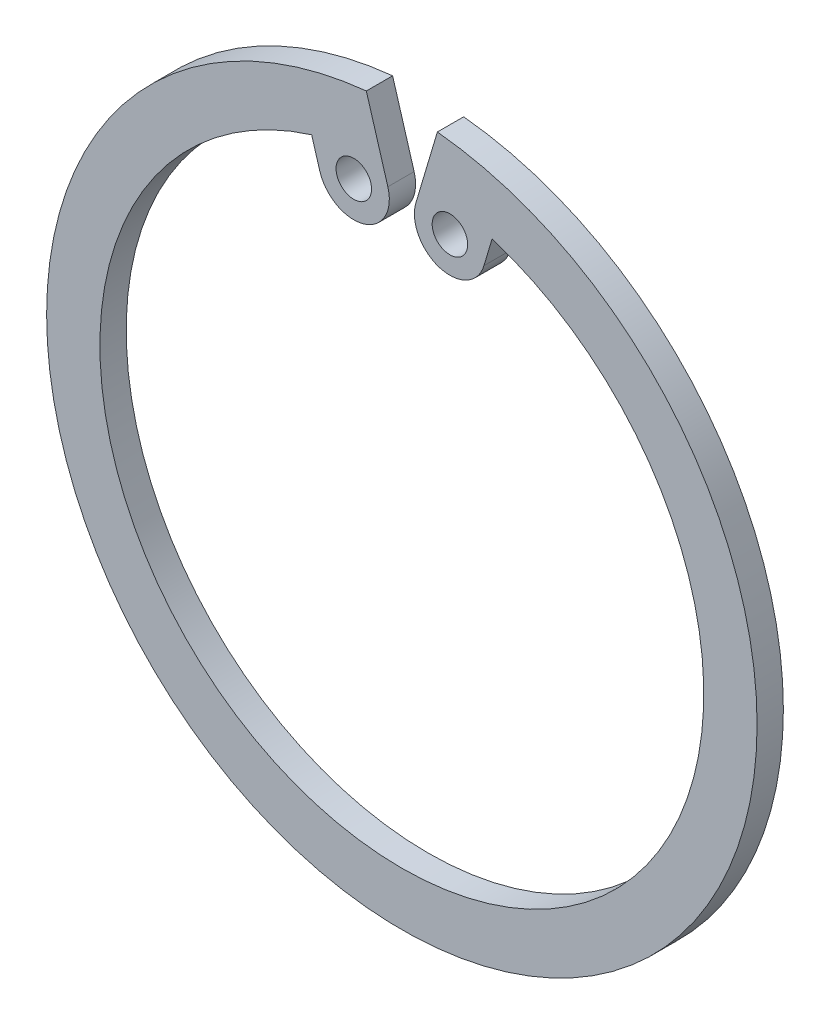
ISO-10303-21;
HEADER;
FILE_DESCRIPTION(('STEP AP214'),'2;1');
FILE_NAME('part.step','',(''),(''),'','','');
FILE_SCHEMA(('AUTOMOTIVE_DESIGN { 1 0 10303 214 1 1 1 1 }'));
ENDSEC;
DATA;
#1=APPLICATION_CONTEXT('core data for automotive mechanical design processes');
#2=APPLICATION_PROTOCOL_DEFINITION('international standard','automotive_design',2000,#1);
#3=PRODUCT_CONTEXT('',#1,'mechanical');
#4=PRODUCT('Part','Part','',(#3));
#5=PRODUCT_RELATED_PRODUCT_CATEGORY('part','',(#4));
#6=PRODUCT_DEFINITION_FORMATION('','',#4);
#7=PRODUCT_DEFINITION_CONTEXT('part definition',#1,'design');
#8=PRODUCT_DEFINITION('design','',#6,#7);
#9=PRODUCT_DEFINITION_SHAPE('','',#8);
#10=(LENGTH_UNIT() NAMED_UNIT(*) SI_UNIT(.MILLI.,.METRE.));
#11=(NAMED_UNIT(*) PLANE_ANGLE_UNIT() SI_UNIT($,.RADIAN.));
#12=(NAMED_UNIT(*) SI_UNIT($,.STERADIAN.) SOLID_ANGLE_UNIT());
#13=UNCERTAINTY_MEASURE_WITH_UNIT(LENGTH_MEASURE(1.E-05),#10,'distance_accuracy_value','');
#14=(GEOMETRIC_REPRESENTATION_CONTEXT(3) GLOBAL_UNCERTAINTY_ASSIGNED_CONTEXT((#13)) GLOBAL_UNIT_ASSIGNED_CONTEXT((#10,
#11,#12)) REPRESENTATION_CONTEXT('',''));
#15=CARTESIAN_POINT('',(0.,0.,0.));
#16=DIRECTION('',(0.,0.,1.));
#17=DIRECTION('',(1.,0.,0.));
#18=AXIS2_PLACEMENT_3D('',#15,#16,#17);
#19=CARTESIAN_POINT('',(2.70579329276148,15.262001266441,1.48));
#20=DIRECTION('',(0.,0.,-1.));
#21=DIRECTION('',(-1.,0.,0.));
#22=AXIS2_PLACEMENT_3D('',#19,#20,#21);
#23=PLANE('',#22);
#24=CARTESIAN_POINT('',(2.70579329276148,15.262001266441,1.48));
#25=DIRECTION('',(0.,0.,1.));
#26=DIRECTION('',(1.,0.,0.));
#27=AXIS2_PLACEMENT_3D('',#24,#25,#26);
#28=CIRCLE('',#27,1.);
#29=CARTESIAN_POINT('',(3.70579329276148,15.262001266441,1.48));
#30=VERTEX_POINT('',#29);
#31=EDGE_CURVE('E107',#30,#30,#28,.T.);
#32=ORIENTED_EDGE('',*,*,#31,.F.);
#33=EDGE_LOOP('',(#32));
#34=FACE_BOUND('',#33,.T.);
#35=CARTESIAN_POINT('',(2.70579329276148,15.262001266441,1.48));
#36=DIRECTION('',(0.,0.,-1.));
#37=DIRECTION('',(-1.,0.,0.));
#38=AXIS2_PLACEMENT_3D('',#35,#36,#37);
#39=CIRCLE('',#38,2.);
#40=CARTESIAN_POINT('',(4.62261719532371,14.6912244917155,1.48));
#41=VERTEX_POINT('',#40);
#42=CARTESIAN_POINT('',(0.788969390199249,15.8327780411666,1.48));
#43=VERTEX_POINT('',#42);
#44=EDGE_CURVE('E90',#41,#43,#39,.T.);
#45=ORIENTED_EDGE('',*,*,#44,.F.);
#46=DIRECTION('',(-0.285388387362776,-0.958411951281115,0.));
#47=VECTOR('',#46,1.);
#48=CARTESIAN_POINT('',(5.07891104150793,16.2235835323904,1.48));
#49=LINE('',#48,#47);
#50=CARTESIAN_POINT('',(5.07891104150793,16.2235835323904,1.48));
#51=VERTEX_POINT('',#50);
#52=EDGE_CURVE('E96',#51,#41,#49,.T.);
#53=ORIENTED_EDGE('',*,*,#52,.F.);
#54=CARTESIAN_POINT('',(0.,0.,1.48));
#55=DIRECTION('',(0.,0.,1.));
#56=DIRECTION('',(1.,0.,0.));
#57=AXIS2_PLACEMENT_3D('',#54,#55,#56);
#58=CIRCLE('',#57,17.);
#59=CARTESIAN_POINT('',(-5.07891104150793,16.2235835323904,1.48));
#60=VERTEX_POINT('',#59);
#61=EDGE_CURVE('E142',#60,#51,#58,.T.);
#62=ORIENTED_EDGE('',*,*,#61,.F.);
#63=DIRECTION('',(0.285388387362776,-0.958411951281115,0.));
#64=VECTOR('',#63,1.);
#65=CARTESIAN_POINT('',(-5.07891104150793,16.2235835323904,1.48));
#66=LINE('',#65,#64);
#67=CARTESIAN_POINT('',(-4.62261719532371,14.6912244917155,1.48));
#68=VERTEX_POINT('',#67);
#69=EDGE_CURVE('E139',#60,#68,#66,.T.);
#70=ORIENTED_EDGE('',*,*,#69,.T.);
#71=CARTESIAN_POINT('',(-2.70579329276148,15.262001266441,1.48));
#72=DIRECTION('',(0.,0.,1.));
#73=DIRECTION('',(1.,0.,0.));
#74=AXIS2_PLACEMENT_3D('',#71,#72,#73);
#75=CIRCLE('',#74,2.);
#76=CARTESIAN_POINT('',(-0.788969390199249,15.8327780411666,1.48));
#77=VERTEX_POINT('',#76);
#78=EDGE_CURVE('E136',#68,#77,#75,.T.);
#79=ORIENTED_EDGE('',*,*,#78,.T.);
#80=DIRECTION('',(-0.285388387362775,0.958411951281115,0.));
#81=VECTOR('',#80,1.);
#82=CARTESIAN_POINT('',(-0.788969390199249,15.8327780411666,1.48));
#83=LINE('',#82,#81);
#84=CARTESIAN_POINT('',(-2.,19.8997487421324,1.48));
#85=VERTEX_POINT('',#84);
#86=EDGE_CURVE('E133',#77,#85,#83,.T.);
#87=ORIENTED_EDGE('',*,*,#86,.T.);
#88=CARTESIAN_POINT('',(0.,0.,1.48));
#89=DIRECTION('',(0.,0.,1.));
#90=DIRECTION('',(1.,0.,0.));
#91=AXIS2_PLACEMENT_3D('',#88,#89,#90);
#92=CIRCLE('',#91,20.);
#93=CARTESIAN_POINT('',(2.,19.8997487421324,1.48));
#94=VERTEX_POINT('',#93);
#95=EDGE_CURVE('E130',#85,#94,#92,.T.);
#96=ORIENTED_EDGE('',*,*,#95,.T.);
#97=DIRECTION('',(0.285388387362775,0.958411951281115,0.));
#98=VECTOR('',#97,1.);
#99=CARTESIAN_POINT('',(0.788969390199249,15.8327780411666,1.48));
#100=LINE('',#99,#98);
#101=EDGE_CURVE('E128',#43,#94,#100,.T.);
#102=ORIENTED_EDGE('',*,*,#101,.F.);
#103=EDGE_LOOP('',(#45,#53,#62,#70,#79,#87,#96,#102));
#104=FACE_BOUND('',#103,.T.);
#105=CARTESIAN_POINT('',(-2.70579329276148,15.262001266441,1.48));
#106=DIRECTION('',(0.,0.,1.));
#107=DIRECTION('',(1.,0.,0.));
#108=AXIS2_PLACEMENT_3D('',#105,#106,#107);
#109=CIRCLE('',#108,1.);
#110=CARTESIAN_POINT('',(-1.70579329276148,15.262001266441,1.48));
#111=VERTEX_POINT('',#110);
#112=EDGE_CURVE('E232',#111,#111,#109,.T.);
#113=ORIENTED_EDGE('',*,*,#112,.F.);
#114=EDGE_LOOP('',(#113));
#115=FACE_BOUND('',#114,.T.);
#116=ADVANCED_FACE('F24',(#34,#104,#115),#23,.F.);
#117=CARTESIAN_POINT('',(2.70579329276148,15.262001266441,0.));
#118=DIRECTION('',(0.,0.,-1.));
#119=DIRECTION('',(-1.,0.,0.));
#120=AXIS2_PLACEMENT_3D('',#117,#118,#119);
#121=PLANE('',#120);
#122=CARTESIAN_POINT('',(2.70579329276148,15.262001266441,0.));
#123=DIRECTION('',(0.,0.,1.));
#124=DIRECTION('',(1.,0.,0.));
#125=AXIS2_PLACEMENT_3D('',#122,#123,#124);
#126=CIRCLE('',#125,1.);
#127=CARTESIAN_POINT('',(3.70579329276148,15.262001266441,0.));
#128=VERTEX_POINT('',#127);
#129=EDGE_CURVE('E237',#128,#128,#126,.T.);
#130=ORIENTED_EDGE('',*,*,#129,.T.);
#131=EDGE_LOOP('',(#130));
#132=FACE_BOUND('',#131,.T.);
#133=CARTESIAN_POINT('',(2.70579329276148,15.262001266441,0.));
#134=DIRECTION('',(0.,0.,-1.));
#135=DIRECTION('',(-1.,0.,0.));
#136=AXIS2_PLACEMENT_3D('',#133,#134,#135);
#137=CIRCLE('',#136,2.);
#138=CARTESIAN_POINT('',(4.62261719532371,14.6912244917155,0.));
#139=VERTEX_POINT('',#138);
#140=CARTESIAN_POINT('',(0.788969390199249,15.8327780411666,0.));
#141=VERTEX_POINT('',#140);
#142=EDGE_CURVE('E88',#139,#141,#137,.T.);
#143=ORIENTED_EDGE('',*,*,#142,.T.);
#144=DIRECTION('',(0.285388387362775,0.958411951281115,0.));
#145=VECTOR('',#144,1.);
#146=CARTESIAN_POINT('',(0.788969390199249,15.8327780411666,0.));
#147=LINE('',#146,#145);
#148=CARTESIAN_POINT('',(2.,19.8997487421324,0.));
#149=VERTEX_POINT('',#148);
#150=EDGE_CURVE('E103',#141,#149,#147,.T.);
#151=ORIENTED_EDGE('',*,*,#150,.T.);
#152=CARTESIAN_POINT('',(0.,0.,0.));
#153=DIRECTION('',(0.,0.,1.));
#154=DIRECTION('',(1.,0.,0.));
#155=AXIS2_PLACEMENT_3D('',#152,#153,#154);
#156=CIRCLE('',#155,20.);
#157=CARTESIAN_POINT('',(-2.,19.8997487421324,0.));
#158=VERTEX_POINT('',#157);
#159=EDGE_CURVE('E110',#158,#149,#156,.T.);
#160=ORIENTED_EDGE('',*,*,#159,.F.);
#161=DIRECTION('',(-0.285388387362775,0.958411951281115,0.));
#162=VECTOR('',#161,1.);
#163=CARTESIAN_POINT('',(-0.788969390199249,15.8327780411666,0.));
#164=LINE('',#163,#162);
#165=CARTESIAN_POINT('',(-0.788969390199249,15.8327780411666,0.));
#166=VERTEX_POINT('',#165);
#167=EDGE_CURVE('E112',#166,#158,#164,.T.);
#168=ORIENTED_EDGE('',*,*,#167,.F.);
#169=CARTESIAN_POINT('',(-2.70579329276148,15.262001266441,0.));
#170=DIRECTION('',(0.,0.,1.));
#171=DIRECTION('',(1.,0.,0.));
#172=AXIS2_PLACEMENT_3D('',#169,#170,#171);
#173=CIRCLE('',#172,2.);
#174=CARTESIAN_POINT('',(-4.62261719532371,14.6912244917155,0.));
#175=VERTEX_POINT('',#174);
#176=EDGE_CURVE('E118',#175,#166,#173,.T.);
#177=ORIENTED_EDGE('',*,*,#176,.F.);
#178=DIRECTION('',(0.285388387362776,-0.958411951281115,0.));
#179=VECTOR('',#178,1.);
#180=CARTESIAN_POINT('',(-5.07891104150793,16.2235835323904,0.));
#181=LINE('',#180,#179);
#182=CARTESIAN_POINT('',(-5.07891104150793,16.2235835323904,0.));
#183=VERTEX_POINT('',#182);
#184=EDGE_CURVE('E121',#183,#175,#181,.T.);
#185=ORIENTED_EDGE('',*,*,#184,.F.);
#186=CARTESIAN_POINT('',(0.,0.,0.));
#187=DIRECTION('',(0.,0.,1.));
#188=DIRECTION('',(1.,0.,0.));
#189=AXIS2_PLACEMENT_3D('',#186,#187,#188);
#190=CIRCLE('',#189,17.);
#191=CARTESIAN_POINT('',(5.07891104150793,16.2235835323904,0.));
#192=VERTEX_POINT('',#191);
#193=EDGE_CURVE('E124',#183,#192,#190,.T.);
#194=ORIENTED_EDGE('',*,*,#193,.T.);
#195=DIRECTION('',(-0.285388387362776,-0.958411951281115,0.));
#196=VECTOR('',#195,1.);
#197=CARTESIAN_POINT('',(5.07891104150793,16.2235835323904,0.));
#198=LINE('',#197,#196);
#199=EDGE_CURVE('E106',#192,#139,#198,.T.);
#200=ORIENTED_EDGE('',*,*,#199,.T.);
#201=EDGE_LOOP('',(#143,#151,#160,#168,#177,#185,#194,#200));
#202=FACE_BOUND('',#201,.T.);
#203=CARTESIAN_POINT('',(-2.70579329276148,15.262001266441,0.));
#204=DIRECTION('',(0.,0.,1.));
#205=DIRECTION('',(1.,0.,0.));
#206=AXIS2_PLACEMENT_3D('',#203,#204,#205);
#207=CIRCLE('',#206,1.);
#208=CARTESIAN_POINT('',(-1.70579329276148,15.262001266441,0.));
#209=VERTEX_POINT('',#208);
#210=EDGE_CURVE('E235',#209,#209,#207,.T.);
#211=ORIENTED_EDGE('',*,*,#210,.T.);
#212=EDGE_LOOP('',(#211));
#213=FACE_BOUND('',#212,.T.);
#214=ADVANCED_FACE('F100',(#132,#202,#213),#121,.T.);
#215=CARTESIAN_POINT('',(2.70579329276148,15.262001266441,1.48));
#216=DIRECTION('',(0.,0.,-1.));
#217=DIRECTION('',(-1.,0.,0.));
#218=AXIS2_PLACEMENT_3D('',#215,#216,#217);
#219=CYLINDRICAL_SURFACE('',#218,2.);
#220=DIRECTION('',(0.,0.,-1.));
#221=VECTOR('',#220,1.);
#222=CARTESIAN_POINT('',(4.62261719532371,14.6912244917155,1.48));
#223=LINE('',#222,#221);
#224=EDGE_CURVE('E11',#41,#139,#223,.T.);
#225=ORIENTED_EDGE('',*,*,#224,.F.);
#226=ORIENTED_EDGE('',*,*,#44,.T.);
#227=DIRECTION('',(0.,0.,-1.));
#228=VECTOR('',#227,1.);
#229=CARTESIAN_POINT('',(0.788969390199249,15.8327780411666,1.48));
#230=LINE('',#229,#228);
#231=EDGE_CURVE('E85',#43,#141,#230,.T.);
#232=ORIENTED_EDGE('',*,*,#231,.T.);
#233=ORIENTED_EDGE('',*,*,#142,.F.);
#234=EDGE_LOOP('',(#225,#226,#232,#233));
#235=FACE_BOUND('',#234,.T.);
#236=ADVANCED_FACE('F87',(#235),#219,.T.);
#237=CARTESIAN_POINT('',(5.07891104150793,16.2235835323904,1.48));
#238=DIRECTION('',(0.958411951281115,-0.285388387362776,0.));
#239=DIRECTION('',(0.285388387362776,0.958411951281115,0.));
#240=AXIS2_PLACEMENT_3D('',#237,#238,#239);
#241=PLANE('',#240);
#242=DIRECTION('',(0.,0.,-1.));
#243=VECTOR('',#242,1.);
#244=CARTESIAN_POINT('',(5.07891104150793,16.2235835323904,1.48));
#245=LINE('',#244,#243);
#246=EDGE_CURVE('E32',#51,#192,#245,.T.);
#247=ORIENTED_EDGE('',*,*,#246,.F.);
#248=ORIENTED_EDGE('',*,*,#52,.T.);
#249=ORIENTED_EDGE('',*,*,#224,.T.);
#250=ORIENTED_EDGE('',*,*,#199,.F.);
#251=EDGE_LOOP('',(#247,#248,#249,#250));
#252=FACE_BOUND('',#251,.T.);
#253=ADVANCED_FACE('F26',(#252),#241,.T.);
#254=CARTESIAN_POINT('',(0.,0.,1.48));
#255=DIRECTION('',(0.,0.,-1.));
#256=DIRECTION('',(-1.,0.,0.));
#257=AXIS2_PLACEMENT_3D('',#254,#255,#256);
#258=CYLINDRICAL_SURFACE('',#257,17.);
#259=DIRECTION('',(0.,0.,-1.));
#260=VECTOR('',#259,1.);
#261=CARTESIAN_POINT('',(-5.07891104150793,16.2235835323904,1.48));
#262=LINE('',#261,#260);
#263=EDGE_CURVE('E152',#60,#183,#262,.T.);
#264=ORIENTED_EDGE('',*,*,#263,.F.);
#265=ORIENTED_EDGE('',*,*,#61,.T.);
#266=ORIENTED_EDGE('',*,*,#246,.T.);
#267=ORIENTED_EDGE('',*,*,#193,.F.);
#268=EDGE_LOOP('',(#264,#265,#266,#267));
#269=FACE_BOUND('',#268,.T.);
#270=ADVANCED_FACE('F155',(#269),#258,.F.);
#271=CARTESIAN_POINT('',(-5.07891104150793,16.2235835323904,1.48));
#272=DIRECTION('',(0.958411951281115,0.285388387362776,0.));
#273=DIRECTION('',(-0.285388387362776,0.958411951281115,0.));
#274=AXIS2_PLACEMENT_3D('',#271,#272,#273);
#275=PLANE('',#274);
#276=DIRECTION('',(0.,0.,-1.));
#277=VECTOR('',#276,1.);
#278=CARTESIAN_POINT('',(-4.62261719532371,14.6912244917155,1.48));
#279=LINE('',#278,#277);
#280=EDGE_CURVE('E150',#68,#175,#279,.T.);
#281=ORIENTED_EDGE('',*,*,#280,.F.);
#282=ORIENTED_EDGE('',*,*,#69,.F.);
#283=ORIENTED_EDGE('',*,*,#263,.T.);
#284=ORIENTED_EDGE('',*,*,#184,.T.);
#285=EDGE_LOOP('',(#281,#282,#283,#284));
#286=FACE_BOUND('',#285,.T.);
#287=ADVANCED_FACE('F173',(#286),#275,.F.);
#288=CARTESIAN_POINT('',(-2.70579329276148,15.262001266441,1.48));
#289=DIRECTION('',(0.,0.,-1.));
#290=DIRECTION('',(-1.,0.,0.));
#291=AXIS2_PLACEMENT_3D('',#288,#289,#290);
#292=CYLINDRICAL_SURFACE('',#291,2.);
#293=DIRECTION('',(0.,0.,-1.));
#294=VECTOR('',#293,1.);
#295=CARTESIAN_POINT('',(-0.788969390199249,15.8327780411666,1.48));
#296=LINE('',#295,#294);
#297=EDGE_CURVE('E148',#77,#166,#296,.T.);
#298=ORIENTED_EDGE('',*,*,#297,.F.);
#299=ORIENTED_EDGE('',*,*,#78,.F.);
#300=ORIENTED_EDGE('',*,*,#280,.T.);
#301=ORIENTED_EDGE('',*,*,#176,.T.);
#302=EDGE_LOOP('',(#298,#299,#300,#301));
#303=FACE_BOUND('',#302,.T.);
#304=ADVANCED_FACE('F171',(#303),#292,.T.);
#305=CARTESIAN_POINT('',(-0.788969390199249,15.8327780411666,1.48));
#306=DIRECTION('',(-0.958411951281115,-0.285388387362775,0.));
#307=DIRECTION('',(0.285388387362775,-0.958411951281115,0.));
#308=AXIS2_PLACEMENT_3D('',#305,#306,#307);
#309=PLANE('',#308);
#310=DIRECTION('',(0.,0.,-1.));
#311=VECTOR('',#310,1.);
#312=CARTESIAN_POINT('',(-2.,19.8997487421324,1.48));
#313=LINE('',#312,#311);
#314=EDGE_CURVE('E146',#85,#158,#313,.T.);
#315=ORIENTED_EDGE('',*,*,#314,.F.);
#316=ORIENTED_EDGE('',*,*,#86,.F.);
#317=ORIENTED_EDGE('',*,*,#297,.T.);
#318=ORIENTED_EDGE('',*,*,#167,.T.);
#319=EDGE_LOOP('',(#315,#316,#317,#318));
#320=FACE_BOUND('',#319,.T.);
#321=ADVANCED_FACE('F168',(#320),#309,.F.);
#322=CARTESIAN_POINT('',(0.,0.,1.48));
#323=DIRECTION('',(0.,0.,-1.));
#324=DIRECTION('',(-1.,0.,0.));
#325=AXIS2_PLACEMENT_3D('',#322,#323,#324);
#326=CYLINDRICAL_SURFACE('',#325,20.);
#327=DIRECTION('',(0.,0.,-1.));
#328=VECTOR('',#327,1.);
#329=CARTESIAN_POINT('',(2.,19.8997487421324,1.48));
#330=LINE('',#329,#328);
#331=EDGE_CURVE('E95',#94,#149,#330,.T.);
#332=ORIENTED_EDGE('',*,*,#331,.F.);
#333=ORIENTED_EDGE('',*,*,#95,.F.);
#334=ORIENTED_EDGE('',*,*,#314,.T.);
#335=ORIENTED_EDGE('',*,*,#159,.T.);
#336=EDGE_LOOP('',(#332,#333,#334,#335));
#337=FACE_BOUND('',#336,.T.);
#338=ADVANCED_FACE('F165',(#337),#326,.T.);
#339=CARTESIAN_POINT('',(0.788969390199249,15.8327780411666,1.48));
#340=DIRECTION('',(-0.958411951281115,0.285388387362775,0.));
#341=DIRECTION('',(-0.285388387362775,-0.958411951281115,0.));
#342=AXIS2_PLACEMENT_3D('',#339,#340,#341);
#343=PLANE('',#342);
#344=ORIENTED_EDGE('',*,*,#101,.T.);
#345=ORIENTED_EDGE('',*,*,#331,.T.);
#346=ORIENTED_EDGE('',*,*,#150,.F.);
#347=ORIENTED_EDGE('',*,*,#231,.F.);
#348=EDGE_LOOP('',(#344,#345,#346,#347));
#349=FACE_BOUND('',#348,.T.);
#350=ADVANCED_FACE('F109',(#349),#343,.T.);
#351=CARTESIAN_POINT('',(2.70579329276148,15.262001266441,1.48));
#352=DIRECTION('',(0.,0.,-1.));
#353=DIRECTION('',(-1.,0.,0.));
#354=AXIS2_PLACEMENT_3D('',#351,#352,#353);
#355=CYLINDRICAL_SURFACE('',#354,1.);
#356=ORIENTED_EDGE('',*,*,#31,.T.);
#357=EDGE_LOOP('',(#356));
#358=FACE_BOUND('',#357,.T.);
#359=ORIENTED_EDGE('',*,*,#129,.F.);
#360=EDGE_LOOP('',(#359));
#361=FACE_BOUND('',#360,.T.);
#362=ADVANCED_FACE('F197',(#358,#361),#355,.F.);
#363=CARTESIAN_POINT('',(-2.70579329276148,15.262001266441,1.48));
#364=DIRECTION('',(0.,0.,-1.));
#365=DIRECTION('',(-1.,0.,0.));
#366=AXIS2_PLACEMENT_3D('',#363,#364,#365);
#367=CYLINDRICAL_SURFACE('',#366,1.);
#368=ORIENTED_EDGE('',*,*,#112,.T.);
#369=EDGE_LOOP('',(#368));
#370=FACE_BOUND('',#369,.T.);
#371=ORIENTED_EDGE('',*,*,#210,.F.);
#372=EDGE_LOOP('',(#371));
#373=FACE_BOUND('',#372,.T.);
#374=ADVANCED_FACE('F219',(#370,#373),#367,.F.);
#375=CLOSED_SHELL('',(#116,#214,#236,#253,#270,#287,#304,#321,#338,#350,#362,#374));
#376=MANIFOLD_SOLID_BREP('B2',#375);
#377=ADVANCED_BREP_SHAPE_REPRESENTATION('',(#18,#376),#14);
#378=SHAPE_DEFINITION_REPRESENTATION(#9,#377);
ENDSEC;
END-ISO-10303-21;
